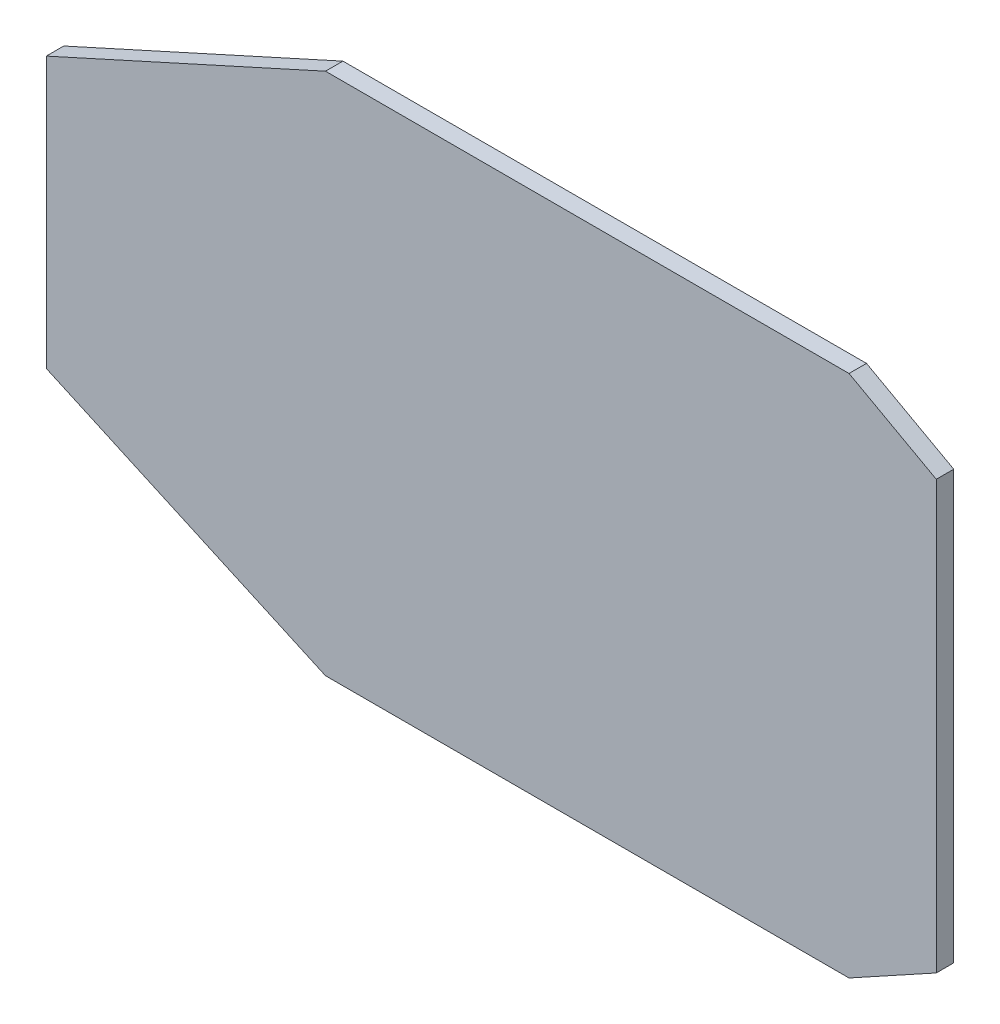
ISO-10303-21;
HEADER;
FILE_DESCRIPTION(('STEP AP214'),'2;1');
FILE_NAME('part.step','',(''),(''),'','','');
FILE_SCHEMA(('AUTOMOTIVE_DESIGN { 1 0 10303 214 1 1 1 1 }'));
ENDSEC;
DATA;
#1=APPLICATION_CONTEXT('core data for automotive mechanical design processes');
#2=APPLICATION_PROTOCOL_DEFINITION('international standard','automotive_design',2000,#1);
#3=PRODUCT_CONTEXT('',#1,'mechanical');
#4=PRODUCT('Part','Part','',(#3));
#5=PRODUCT_RELATED_PRODUCT_CATEGORY('part','',(#4));
#6=PRODUCT_DEFINITION_FORMATION('','',#4);
#7=PRODUCT_DEFINITION_CONTEXT('part definition',#1,'design');
#8=PRODUCT_DEFINITION('design','',#6,#7);
#9=PRODUCT_DEFINITION_SHAPE('','',#8);
#10=(LENGTH_UNIT() NAMED_UNIT(*) SI_UNIT(.MILLI.,.METRE.));
#11=(NAMED_UNIT(*) PLANE_ANGLE_UNIT() SI_UNIT($,.RADIAN.));
#12=(NAMED_UNIT(*) SI_UNIT($,.STERADIAN.) SOLID_ANGLE_UNIT());
#13=UNCERTAINTY_MEASURE_WITH_UNIT(LENGTH_MEASURE(1.E-05),#10,'distance_accuracy_value','');
#14=(GEOMETRIC_REPRESENTATION_CONTEXT(3) GLOBAL_UNCERTAINTY_ASSIGNED_CONTEXT((#13)) GLOBAL_UNIT_ASSIGNED_CONTEXT((#10,
#11,#12)) REPRESENTATION_CONTEXT('',''));
#15=CARTESIAN_POINT('',(0.,0.,0.));
#16=DIRECTION('',(0.,0.,1.));
#17=DIRECTION('',(1.,0.,0.));
#18=AXIS2_PLACEMENT_3D('',#15,#16,#17);
#19=CARTESIAN_POINT('',(1.11022302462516E-13,0.,9.99999999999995));
#20=DIRECTION('',(1.00000000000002,0.,0.));
#21=DIRECTION('',(0.,0.,-1.));
#22=AXIS2_PLACEMENT_3D('',#19,#20,#21);
#23=PLANE('',#22);
#24=DIRECTION('',(0.,-1.00000000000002,0.));
#25=VECTOR('',#24,1.);
#26=CARTESIAN_POINT('',(0.,0.,0.));
#27=LINE('',#26,#25);
#28=CARTESIAN_POINT('',(-4.10782519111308E-12,227.500000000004,0.));
#29=VERTEX_POINT('',#28);
#30=CARTESIAN_POINT('',(-3.99680288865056E-12,72.500000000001,0.));
#31=VERTEX_POINT('',#30);
#32=EDGE_CURVE('E163',#29,#31,#27,.T.);
#33=ORIENTED_EDGE('',*,*,#32,.T.);
#34=DIRECTION('',(0.,0.,1.));
#35=VECTOR('',#34,1.);
#36=CARTESIAN_POINT('',(-4.10782519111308E-12,72.500000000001,10.0000000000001));
#37=LINE('',#36,#35);
#38=CARTESIAN_POINT('',(-4.10782519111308E-12,72.500000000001,10.0000000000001));
#39=VERTEX_POINT('',#38);
#40=EDGE_CURVE('E39',#31,#39,#37,.T.);
#41=ORIENTED_EDGE('',*,*,#40,.T.);
#42=DIRECTION('',(0.,-1.00000000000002,0.));
#43=VECTOR('',#42,1.);
#44=CARTESIAN_POINT('',(1.11022302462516E-13,0.,9.99999999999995));
#45=LINE('',#44,#43);
#46=CARTESIAN_POINT('',(-4.10782519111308E-12,227.500000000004,9.9999999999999));
#47=VERTEX_POINT('',#46);
#48=EDGE_CURVE('E118',#47,#39,#45,.T.);
#49=ORIENTED_EDGE('',*,*,#48,.F.);
#50=DIRECTION('',(0.,0.,-1.));
#51=VECTOR('',#50,1.);
#52=CARTESIAN_POINT('',(-4.10782519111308E-12,227.500000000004,9.9999999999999));
#53=LINE('',#52,#51);
#54=EDGE_CURVE('E145',#47,#29,#53,.T.);
#55=ORIENTED_EDGE('',*,*,#54,.T.);
#56=EDGE_LOOP('',(#33,#41,#49,#55));
#57=FACE_BOUND('',#56,.T.);
#58=ADVANCED_FACE('F32',(#57),#23,.F.);
#59=CARTESIAN_POINT('',(1.11022302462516E-13,0.,9.99999999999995));
#60=DIRECTION('',(0.,1.00000000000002,0.));
#61=DIRECTION('',(0.,0.,1.));
#62=AXIS2_PLACEMENT_3D('',#59,#60,#61);
#63=PLANE('',#62);
#64=DIRECTION('',(1.00000000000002,0.,0.));
#65=VECTOR('',#64,1.);
#66=CARTESIAN_POINT('',(1.11022302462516E-13,0.,9.99999999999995));
#67=LINE('',#66,#65);
#68=CARTESIAN_POINT('',(160.000000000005,0.,9.99999999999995));
#69=VERTEX_POINT('',#68);
#70=CARTESIAN_POINT('',(460.000000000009,0.,9.99999999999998));
#71=VERTEX_POINT('',#70);
#72=EDGE_CURVE('E121',#69,#71,#67,.T.);
#73=ORIENTED_EDGE('',*,*,#72,.F.);
#74=DIRECTION('',(0.,0.,-1.));
#75=VECTOR('',#74,1.);
#76=CARTESIAN_POINT('',(160.000000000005,0.,10.));
#77=LINE('',#76,#75);
#78=CARTESIAN_POINT('',(160.000000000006,0.,-1.94289029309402E-13));
#79=VERTEX_POINT('',#78);
#80=EDGE_CURVE('E153',#69,#79,#77,.T.);
#81=ORIENTED_EDGE('',*,*,#80,.T.);
#82=DIRECTION('',(1.00000000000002,0.,0.));
#83=VECTOR('',#82,1.);
#84=CARTESIAN_POINT('',(0.,0.,0.));
#85=LINE('',#84,#83);
#86=CARTESIAN_POINT('',(460.00000000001,-2.22044604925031E-13,2.22044604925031E-13));
#87=VERTEX_POINT('',#86);
#88=EDGE_CURVE('E123',#79,#87,#85,.T.);
#89=ORIENTED_EDGE('',*,*,#88,.T.);
#90=DIRECTION('',(0.,0.,1.));
#91=VECTOR('',#90,1.);
#92=CARTESIAN_POINT('',(460.00000000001,0.,10.0000000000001));
#93=LINE('',#92,#91);
#94=EDGE_CURVE('E140',#87,#71,#93,.T.);
#95=ORIENTED_EDGE('',*,*,#94,.T.);
#96=EDGE_LOOP('',(#73,#81,#89,#95));
#97=FACE_BOUND('',#96,.T.);
#98=ADVANCED_FACE('F159',(#97),#63,.F.);
#99=CARTESIAN_POINT('',(510.000000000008,0.,10.0000000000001));
#100=DIRECTION('',(-1.00000000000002,0.,0.));
#101=DIRECTION('',(0.,0.,1.));
#102=AXIS2_PLACEMENT_3D('',#99,#100,#101);
#103=PLANE('',#102);
#104=DIRECTION('',(0.,1.00000000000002,0.));
#105=VECTOR('',#104,1.);
#106=CARTESIAN_POINT('',(510.000000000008,0.,10.0000000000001));
#107=LINE('',#106,#105);
#108=CARTESIAN_POINT('',(510.000000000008,27.5000000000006,10.));
#109=VERTEX_POINT('',#108);
#110=CARTESIAN_POINT('',(510.000000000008,272.500000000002,9.99999999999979));
#111=VERTEX_POINT('',#110);
#112=EDGE_CURVE('E128',#109,#111,#107,.T.);
#113=ORIENTED_EDGE('',*,*,#112,.F.);
#114=DIRECTION('',(0.,0.,-1.));
#115=VECTOR('',#114,1.);
#116=CARTESIAN_POINT('',(510.000000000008,27.5000000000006,10.));
#117=LINE('',#116,#115);
#118=CARTESIAN_POINT('',(510.000000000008,27.5000000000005,0.));
#119=VERTEX_POINT('',#118);
#120=EDGE_CURVE('E134',#109,#119,#117,.T.);
#121=ORIENTED_EDGE('',*,*,#120,.T.);
#122=DIRECTION('',(0.,1.00000000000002,0.));
#123=VECTOR('',#122,1.);
#124=CARTESIAN_POINT('',(510.000000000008,0.,0.));
#125=LINE('',#124,#123);
#126=CARTESIAN_POINT('',(510.000000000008,272.500000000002,0.));
#127=VERTEX_POINT('',#126);
#128=EDGE_CURVE('E119',#119,#127,#125,.T.);
#129=ORIENTED_EDGE('',*,*,#128,.T.);
#130=DIRECTION('',(0.,0.,1.));
#131=VECTOR('',#130,1.);
#132=CARTESIAN_POINT('',(510.000000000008,272.500000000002,10.));
#133=LINE('',#132,#131);
#134=EDGE_CURVE('E103',#127,#111,#133,.T.);
#135=ORIENTED_EDGE('',*,*,#134,.T.);
#136=EDGE_LOOP('',(#113,#121,#129,#135));
#137=FACE_BOUND('',#136,.T.);
#138=ADVANCED_FACE('F176',(#137),#103,.F.);
#139=CARTESIAN_POINT('',(1.22124532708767E-12,300.000000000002,9.99999999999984));
#140=DIRECTION('',(0.,-1.00000000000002,0.));
#141=DIRECTION('',(0.,0.,-1.));
#142=AXIS2_PLACEMENT_3D('',#139,#140,#141);
#143=PLANE('',#142);
#144=DIRECTION('',(-1.00000000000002,0.,0.));
#145=VECTOR('',#144,1.);
#146=CARTESIAN_POINT('',(1.11022302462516E-13,300.000000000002,0.));
#147=LINE('',#146,#145);
#148=CARTESIAN_POINT('',(460.00000000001,300.000000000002,-1.11022302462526E-13));
#149=VERTEX_POINT('',#148);
#150=CARTESIAN_POINT('',(160.000000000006,300.000000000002,-4.44089209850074E-13));
#151=VERTEX_POINT('',#150);
#152=EDGE_CURVE('E111',#149,#151,#147,.T.);
#153=ORIENTED_EDGE('',*,*,#152,.T.);
#154=DIRECTION('',(0.,0.,1.));
#155=VECTOR('',#154,1.);
#156=CARTESIAN_POINT('',(160.000000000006,300.000000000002,9.99999999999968));
#157=LINE('',#156,#155);
#158=CARTESIAN_POINT('',(160.000000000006,300.000000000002,9.99999999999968));
#159=VERTEX_POINT('',#158);
#160=EDGE_CURVE('E149',#151,#159,#157,.T.);
#161=ORIENTED_EDGE('',*,*,#160,.T.);
#162=DIRECTION('',(-1.00000000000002,0.,0.));
#163=VECTOR('',#162,1.);
#164=CARTESIAN_POINT('',(1.22124532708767E-12,300.000000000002,9.99999999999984));
#165=LINE('',#164,#163);
#166=CARTESIAN_POINT('',(460.000000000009,300.000000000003,9.99999999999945));
#167=VERTEX_POINT('',#166);
#168=EDGE_CURVE('E114',#167,#159,#165,.T.);
#169=ORIENTED_EDGE('',*,*,#168,.F.);
#170=DIRECTION('',(0.,0.,-1.));
#171=VECTOR('',#170,1.);
#172=CARTESIAN_POINT('',(460.00000000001,300.000000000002,9.99999999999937));
#173=LINE('',#172,#171);
#174=EDGE_CURVE('E101',#167,#149,#173,.T.);
#175=ORIENTED_EDGE('',*,*,#174,.T.);
#176=EDGE_LOOP('',(#153,#161,#169,#175));
#177=FACE_BOUND('',#176,.T.);
#178=ADVANCED_FACE('F110',(#177),#143,.F.);
#179=CARTESIAN_POINT('',(1.22124532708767E-12,300.000000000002,9.99999999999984));
#180=DIRECTION('',(0.,0.,-1.));
#181=DIRECTION('',(-1.00000000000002,0.,0.));
#182=AXIS2_PLACEMENT_3D('',#179,#180,#181);
#183=PLANE('',#182);
#184=ORIENTED_EDGE('',*,*,#48,.T.);
#185=DIRECTION('',(-0.910853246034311,0.412730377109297,0.));
#186=VECTOR('',#185,1.);
#187=CARTESIAN_POINT('',(160.000000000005,0.,10.));
#188=LINE('',#187,#186);
#189=EDGE_CURVE('E11',#39,#69,#188,.F.);
#190=ORIENTED_EDGE('',*,*,#189,.T.);
#191=ORIENTED_EDGE('',*,*,#72,.T.);
#192=DIRECTION('',(-0.876215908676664,-0.481918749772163,0.));
#193=VECTOR('',#192,1.);
#194=CARTESIAN_POINT('',(510.000000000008,27.5000000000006,10.));
#195=LINE('',#194,#193);
#196=EDGE_CURVE('E143',#71,#109,#195,.F.);
#197=ORIENTED_EDGE('',*,*,#196,.T.);
#198=ORIENTED_EDGE('',*,*,#112,.T.);
#199=DIRECTION('',(0.87621590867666,-0.481918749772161,0.));
#200=VECTOR('',#199,1.);
#201=CARTESIAN_POINT('',(460.00000000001,300.000000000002,9.99999999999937));
#202=LINE('',#201,#200);
#203=EDGE_CURVE('E132',#111,#167,#202,.F.);
#204=ORIENTED_EDGE('',*,*,#203,.T.);
#205=ORIENTED_EDGE('',*,*,#168,.T.);
#206=DIRECTION('',(0.910853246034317,0.412730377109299,0.));
#207=VECTOR('',#206,1.);
#208=CARTESIAN_POINT('',(-4.10782519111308E-12,227.500000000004,9.9999999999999));
#209=LINE('',#208,#207);
#210=EDGE_CURVE('E151',#159,#47,#209,.F.);
#211=ORIENTED_EDGE('',*,*,#210,.T.);
#212=EDGE_LOOP('',(#184,#190,#191,#197,#198,#204,#205,#211));
#213=FACE_BOUND('',#212,.T.);
#214=ADVANCED_FACE('F168',(#213),#183,.F.);
#215=CARTESIAN_POINT('',(1.11022302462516E-13,300.000000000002,0.));
#216=DIRECTION('',(0.,0.,-1.));
#217=DIRECTION('',(-1.00000000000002,0.,0.));
#218=AXIS2_PLACEMENT_3D('',#215,#216,#217);
#219=PLANE('',#218);
#220=ORIENTED_EDGE('',*,*,#88,.F.);
#221=DIRECTION('',(0.910853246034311,-0.412730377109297,0.));
#222=VECTOR('',#221,1.);
#223=CARTESIAN_POINT('',(-85.5256228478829,111.253797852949,0.));
#224=LINE('',#223,#222);
#225=EDGE_CURVE('E53',#79,#31,#224,.F.);
#226=ORIENTED_EDGE('',*,*,#225,.T.);
#227=ORIENTED_EDGE('',*,*,#32,.F.);
#228=DIRECTION('',(-0.910853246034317,-0.412730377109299,0.));
#229=VECTOR('',#228,1.);
#230=CARTESIAN_POINT('',(27.2554182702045,239.850111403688,0.));
#231=LINE('',#230,#229);
#232=EDGE_CURVE('E117',#29,#151,#231,.F.);
#233=ORIENTED_EDGE('',*,*,#232,.T.);
#234=ORIENTED_EDGE('',*,*,#152,.F.);
#235=DIRECTION('',(-0.87621590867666,0.481918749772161,0.));
#236=VECTOR('',#235,1.);
#237=CARTESIAN_POINT('',(106.833013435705,494.241842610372,-1.02695629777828E-12));
#238=LINE('',#237,#236);
#239=EDGE_CURVE('E97',#149,#127,#238,.F.);
#240=ORIENTED_EDGE('',*,*,#239,.T.);
#241=ORIENTED_EDGE('',*,*,#128,.F.);
#242=DIRECTION('',(0.876215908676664,0.481918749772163,0.));
#243=VECTOR('',#242,1.);
#244=CARTESIAN_POINT('',(233.512476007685,-124.568138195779,0.));
#245=LINE('',#244,#243);
#246=EDGE_CURVE('E137',#119,#87,#245,.F.);
#247=ORIENTED_EDGE('',*,*,#246,.T.);
#248=EDGE_LOOP('',(#220,#226,#227,#233,#234,#240,#241,#247));
#249=FACE_BOUND('',#248,.T.);
#250=ADVANCED_FACE('F116',(#249),#219,.T.);
#251=CARTESIAN_POINT('',(460.00000000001,300.000000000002,9.99999999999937));
#252=DIRECTION('',(-0.481918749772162,-0.876215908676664,0.));
#253=DIRECTION('',(0.87621590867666,-0.481918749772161,0.));
#254=AXIS2_PLACEMENT_3D('',#251,#252,#253);
#255=PLANE('',#254);
#256=ORIENTED_EDGE('',*,*,#203,.F.);
#257=ORIENTED_EDGE('',*,*,#134,.F.);
#258=ORIENTED_EDGE('',*,*,#239,.F.);
#259=ORIENTED_EDGE('',*,*,#174,.F.);
#260=EDGE_LOOP('',(#256,#257,#258,#259));
#261=FACE_BOUND('',#260,.T.);
#262=ADVANCED_FACE('F100',(#261),#255,.F.);
#263=CARTESIAN_POINT('',(510.000000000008,27.5000000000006,10.));
#264=DIRECTION('',(-0.481918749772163,0.876215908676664,0.));
#265=DIRECTION('',(-0.876215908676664,-0.481918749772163,0.));
#266=AXIS2_PLACEMENT_3D('',#263,#264,#265);
#267=PLANE('',#266);
#268=ORIENTED_EDGE('',*,*,#196,.F.);
#269=ORIENTED_EDGE('',*,*,#94,.F.);
#270=ORIENTED_EDGE('',*,*,#246,.F.);
#271=ORIENTED_EDGE('',*,*,#120,.F.);
#272=EDGE_LOOP('',(#268,#269,#270,#271));
#273=FACE_BOUND('',#272,.T.);
#274=ADVANCED_FACE('F178',(#273),#267,.F.);
#275=CARTESIAN_POINT('',(-4.10782519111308E-12,227.500000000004,9.9999999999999));
#276=DIRECTION('',(0.412730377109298,-0.910853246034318,0.));
#277=DIRECTION('',(0.910853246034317,0.412730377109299,0.));
#278=AXIS2_PLACEMENT_3D('',#275,#276,#277);
#279=PLANE('',#278);
#280=ORIENTED_EDGE('',*,*,#210,.F.);
#281=ORIENTED_EDGE('',*,*,#160,.F.);
#282=ORIENTED_EDGE('',*,*,#232,.F.);
#283=ORIENTED_EDGE('',*,*,#54,.F.);
#284=EDGE_LOOP('',(#280,#281,#282,#283));
#285=FACE_BOUND('',#284,.T.);
#286=ADVANCED_FACE('F171',(#285),#279,.F.);
#287=CARTESIAN_POINT('',(160.000000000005,0.,10.));
#288=DIRECTION('',(0.412730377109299,0.910853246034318,0.));
#289=DIRECTION('',(-0.910853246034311,0.412730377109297,0.));
#290=AXIS2_PLACEMENT_3D('',#287,#288,#289);
#291=PLANE('',#290);
#292=ORIENTED_EDGE('',*,*,#189,.F.);
#293=ORIENTED_EDGE('',*,*,#40,.F.);
#294=ORIENTED_EDGE('',*,*,#225,.F.);
#295=ORIENTED_EDGE('',*,*,#80,.F.);
#296=EDGE_LOOP('',(#292,#293,#294,#295));
#297=FACE_BOUND('',#296,.T.);
#298=ADVANCED_FACE('F166',(#297),#291,.F.);
#299=CLOSED_SHELL('',(#58,#98,#138,#178,#214,#250,#262,#274,#286,#298));
#300=MANIFOLD_SOLID_BREP('B2',#299);
#301=ADVANCED_BREP_SHAPE_REPRESENTATION('',(#18,#300),#14);
#302=SHAPE_DEFINITION_REPRESENTATION(#9,#301);
ENDSEC;
END-ISO-10303-21;
